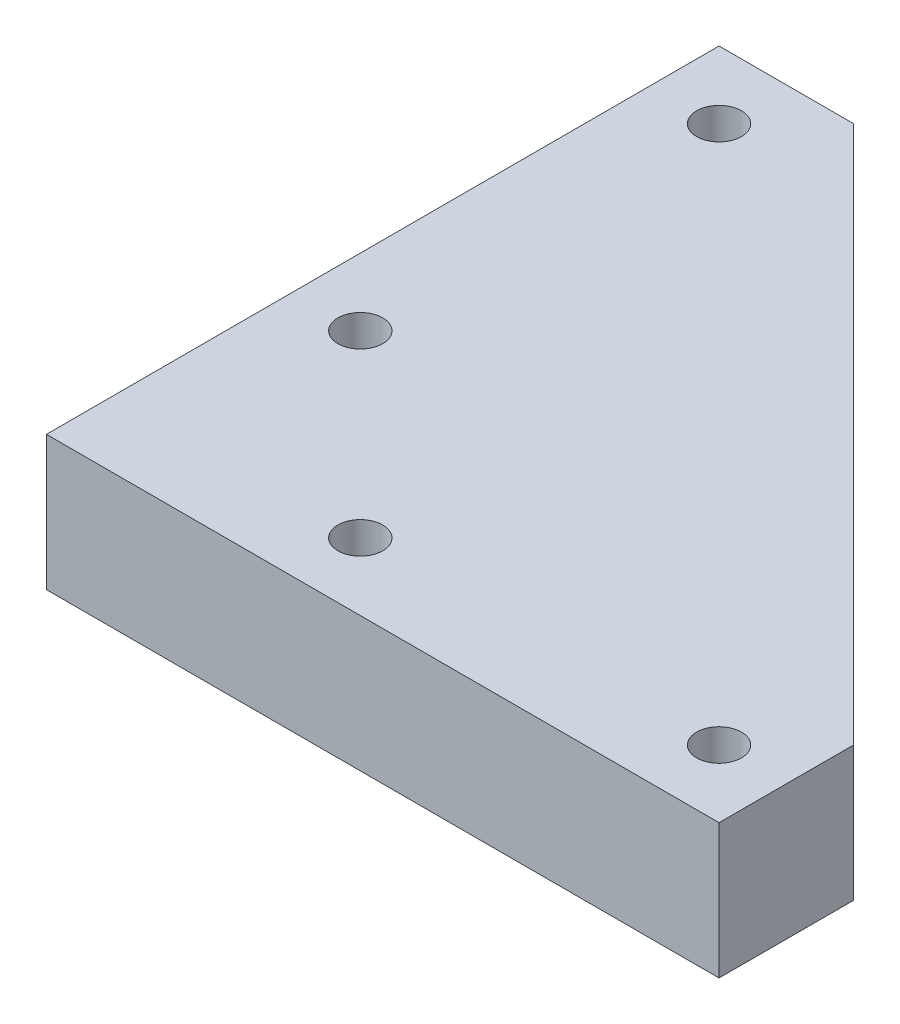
ISO-10303-21;
HEADER;
FILE_DESCRIPTION(('STEP AP214'),'2;1');
FILE_NAME('part.step','',(''),(''),'','','');
FILE_SCHEMA(('AUTOMOTIVE_DESIGN { 1 0 10303 214 1 1 1 1 }'));
ENDSEC;
DATA;
#1=APPLICATION_CONTEXT('core data for automotive mechanical design processes');
#2=APPLICATION_PROTOCOL_DEFINITION('international standard','automotive_design',2000,#1);
#3=PRODUCT_CONTEXT('',#1,'mechanical');
#4=PRODUCT('Part','Part','',(#3));
#5=PRODUCT_RELATED_PRODUCT_CATEGORY('part','',(#4));
#6=PRODUCT_DEFINITION_FORMATION('','',#4);
#7=PRODUCT_DEFINITION_CONTEXT('part definition',#1,'design');
#8=PRODUCT_DEFINITION('design','',#6,#7);
#9=PRODUCT_DEFINITION_SHAPE('','',#8);
#10=(LENGTH_UNIT() NAMED_UNIT(*) SI_UNIT(.MILLI.,.METRE.));
#11=(NAMED_UNIT(*) PLANE_ANGLE_UNIT() SI_UNIT($,.RADIAN.));
#12=(NAMED_UNIT(*) SI_UNIT($,.STERADIAN.) SOLID_ANGLE_UNIT());
#13=UNCERTAINTY_MEASURE_WITH_UNIT(LENGTH_MEASURE(1.E-05),#10,'distance_accuracy_value','');
#14=(GEOMETRIC_REPRESENTATION_CONTEXT(3) GLOBAL_UNCERTAINTY_ASSIGNED_CONTEXT((#13)) GLOBAL_UNIT_ASSIGNED_CONTEXT((#10,
#11,#12)) REPRESENTATION_CONTEXT('',''));
#15=CARTESIAN_POINT('',(0.,0.,0.));
#16=DIRECTION('',(0.,0.,1.));
#17=DIRECTION('',(1.,0.,0.));
#18=AXIS2_PLACEMENT_3D('',#15,#16,#17);
#19=CARTESIAN_POINT('',(0.,19.05,0.));
#20=DIRECTION('',(1.,0.,0.));
#21=DIRECTION('',(0.,0.,-1.));
#22=AXIS2_PLACEMENT_3D('',#19,#20,#21);
#23=PLANE('',#22);
#24=DIRECTION('',(0.,0.,1.));
#25=VECTOR('',#24,1.);
#26=CARTESIAN_POINT('',(0.,0.,0.));
#27=LINE('',#26,#25);
#28=CARTESIAN_POINT('',(0.,0.,0.));
#29=VERTEX_POINT('',#28);
#30=CARTESIAN_POINT('',(0.,0.,95.25));
#31=VERTEX_POINT('',#30);
#32=EDGE_CURVE('E98',#29,#31,#27,.T.);
#33=ORIENTED_EDGE('',*,*,#32,.T.);
#34=DIRECTION('',(0.,-1.,0.));
#35=VECTOR('',#34,1.);
#36=CARTESIAN_POINT('',(0.,19.05,95.25));
#37=LINE('',#36,#35);
#38=CARTESIAN_POINT('',(0.,19.05,95.25));
#39=VERTEX_POINT('',#38);
#40=EDGE_CURVE('E11',#39,#31,#37,.T.);
#41=ORIENTED_EDGE('',*,*,#40,.F.);
#42=DIRECTION('',(0.,0.,1.));
#43=VECTOR('',#42,1.);
#44=CARTESIAN_POINT('',(0.,19.05,0.));
#45=LINE('',#44,#43);
#46=CARTESIAN_POINT('',(0.,19.05,0.));
#47=VERTEX_POINT('',#46);
#48=EDGE_CURVE('E99',#47,#39,#45,.T.);
#49=ORIENTED_EDGE('',*,*,#48,.F.);
#50=DIRECTION('',(0.,-1.,0.));
#51=VECTOR('',#50,1.);
#52=CARTESIAN_POINT('',(0.,19.05,0.));
#53=LINE('',#52,#51);
#54=EDGE_CURVE('E107',#47,#29,#53,.T.);
#55=ORIENTED_EDGE('',*,*,#54,.T.);
#56=EDGE_LOOP('',(#33,#41,#49,#55));
#57=FACE_BOUND('',#56,.T.);
#58=ADVANCED_FACE('F32',(#57),#23,.F.);
#59=CARTESIAN_POINT('',(0.,19.05,95.25));
#60=DIRECTION('',(0.,0.,-1.));
#61=DIRECTION('',(-1.,0.,0.));
#62=AXIS2_PLACEMENT_3D('',#59,#60,#61);
#63=PLANE('',#62);
#64=DIRECTION('',(1.,0.,0.));
#65=VECTOR('',#64,1.);
#66=CARTESIAN_POINT('',(0.,0.,95.25));
#67=LINE('',#66,#65);
#68=CARTESIAN_POINT('',(95.25,0.,95.25));
#69=VERTEX_POINT('',#68);
#70=EDGE_CURVE('E103',#31,#69,#67,.T.);
#71=ORIENTED_EDGE('',*,*,#70,.T.);
#72=DIRECTION('',(0.,-1.,0.));
#73=VECTOR('',#72,1.);
#74=CARTESIAN_POINT('',(95.25,19.05,95.25));
#75=LINE('',#74,#73);
#76=CARTESIAN_POINT('',(95.25,19.05,95.25));
#77=VERTEX_POINT('',#76);
#78=EDGE_CURVE('E39',#77,#69,#75,.T.);
#79=ORIENTED_EDGE('',*,*,#78,.F.);
#80=DIRECTION('',(1.,0.,0.));
#81=VECTOR('',#80,1.);
#82=CARTESIAN_POINT('',(0.,19.05,95.25));
#83=LINE('',#82,#81);
#84=EDGE_CURVE('E78',#39,#77,#83,.T.);
#85=ORIENTED_EDGE('',*,*,#84,.F.);
#86=ORIENTED_EDGE('',*,*,#40,.T.);
#87=EDGE_LOOP('',(#71,#79,#85,#86));
#88=FACE_BOUND('',#87,.T.);
#89=ADVANCED_FACE('F115',(#88),#63,.F.);
#90=CARTESIAN_POINT('',(95.25,19.05,0.));
#91=DIRECTION('',(-1.,0.,0.));
#92=DIRECTION('',(0.,0.,1.));
#93=AXIS2_PLACEMENT_3D('',#90,#91,#92);
#94=PLANE('',#93);
#95=DIRECTION('',(0.,0.,-1.));
#96=VECTOR('',#95,1.);
#97=CARTESIAN_POINT('',(95.25,0.,0.));
#98=LINE('',#97,#96);
#99=CARTESIAN_POINT('',(95.25,0.,76.2));
#100=VERTEX_POINT('',#99);
#101=EDGE_CURVE('E100',#69,#100,#98,.T.);
#102=ORIENTED_EDGE('',*,*,#101,.T.);
#103=DIRECTION('',(0.,1.,0.));
#104=VECTOR('',#103,1.);
#105=CARTESIAN_POINT('',(95.25,0.,76.2));
#106=LINE('',#105,#104);
#107=CARTESIAN_POINT('',(95.25,19.05,76.2));
#108=VERTEX_POINT('',#107);
#109=EDGE_CURVE('E46',#100,#108,#106,.T.);
#110=ORIENTED_EDGE('',*,*,#109,.T.);
#111=DIRECTION('',(0.,0.,-1.));
#112=VECTOR('',#111,1.);
#113=CARTESIAN_POINT('',(95.25,19.05,0.));
#114=LINE('',#113,#112);
#115=EDGE_CURVE('E113',#77,#108,#114,.T.);
#116=ORIENTED_EDGE('',*,*,#115,.F.);
#117=ORIENTED_EDGE('',*,*,#78,.T.);
#118=EDGE_LOOP('',(#102,#110,#116,#117));
#119=FACE_BOUND('',#118,.T.);
#120=ADVANCED_FACE('F111',(#119),#94,.F.);
#121=CARTESIAN_POINT('',(0.,19.05,0.));
#122=DIRECTION('',(0.,0.,1.));
#123=DIRECTION('',(1.,0.,0.));
#124=AXIS2_PLACEMENT_3D('',#121,#122,#123);
#125=PLANE('',#124);
#126=DIRECTION('',(-1.,0.,0.));
#127=VECTOR('',#126,1.);
#128=CARTESIAN_POINT('',(0.,19.05,0.));
#129=LINE('',#128,#127);
#130=CARTESIAN_POINT('',(19.05,19.05,0.));
#131=VERTEX_POINT('',#130);
#132=EDGE_CURVE('E55',#131,#47,#129,.T.);
#133=ORIENTED_EDGE('',*,*,#132,.F.);
#134=DIRECTION('',(0.,1.,0.));
#135=VECTOR('',#134,1.);
#136=CARTESIAN_POINT('',(19.05,0.,0.));
#137=LINE('',#136,#135);
#138=CARTESIAN_POINT('',(19.05,0.,0.));
#139=VERTEX_POINT('',#138);
#140=EDGE_CURVE('E87',#139,#131,#137,.T.);
#141=ORIENTED_EDGE('',*,*,#140,.F.);
#142=DIRECTION('',(-1.,0.,0.));
#143=VECTOR('',#142,1.);
#144=CARTESIAN_POINT('',(0.,0.,0.));
#145=LINE('',#144,#143);
#146=EDGE_CURVE('E73',#139,#29,#145,.T.);
#147=ORIENTED_EDGE('',*,*,#146,.T.);
#148=ORIENTED_EDGE('',*,*,#54,.F.);
#149=EDGE_LOOP('',(#133,#141,#147,#148));
#150=FACE_BOUND('',#149,.T.);
#151=ADVANCED_FACE('F93',(#150),#125,.F.);
#152=CARTESIAN_POINT('',(0.,19.05,0.));
#153=DIRECTION('',(0.,1.,0.));
#154=DIRECTION('',(0.,0.,1.));
#155=AXIS2_PLACEMENT_3D('',#152,#153,#154);
#156=PLANE('',#155);
#157=CARTESIAN_POINT('',(34.925,19.05,85.725));
#158=DIRECTION('',(0.,1.,0.));
#159=DIRECTION('',(0.,0.,1.));
#160=AXIS2_PLACEMENT_3D('',#157,#158,#159);
#161=CIRCLE('',#160,3.175);
#162=CARTESIAN_POINT('',(34.925,19.05,88.9));
#163=VERTEX_POINT('',#162);
#164=EDGE_CURVE('E146',#163,#163,#161,.T.);
#165=ORIENTED_EDGE('',*,*,#164,.F.);
#166=EDGE_LOOP('',(#165));
#167=FACE_BOUND('',#166,.T.);
#168=CARTESIAN_POINT('',(9.525,19.05,60.325));
#169=DIRECTION('',(0.,1.,0.));
#170=DIRECTION('',(0.,0.,1.));
#171=AXIS2_PLACEMENT_3D('',#168,#169,#170);
#172=CIRCLE('',#171,3.175);
#173=CARTESIAN_POINT('',(9.525,19.05,63.5));
#174=VERTEX_POINT('',#173);
#175=EDGE_CURVE('E140',#174,#174,#172,.T.);
#176=ORIENTED_EDGE('',*,*,#175,.F.);
#177=EDGE_LOOP('',(#176));
#178=FACE_BOUND('',#177,.T.);
#179=CARTESIAN_POINT('',(85.725,19.05,85.725));
#180=DIRECTION('',(0.,1.,0.));
#181=DIRECTION('',(0.,0.,1.));
#182=AXIS2_PLACEMENT_3D('',#179,#180,#181);
#183=CIRCLE('',#182,3.175);
#184=CARTESIAN_POINT('',(85.725,19.05,88.9));
#185=VERTEX_POINT('',#184);
#186=EDGE_CURVE('E134',#185,#185,#183,.T.);
#187=ORIENTED_EDGE('',*,*,#186,.F.);
#188=EDGE_LOOP('',(#187));
#189=FACE_BOUND('',#188,.T.);
#190=CARTESIAN_POINT('',(9.52500000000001,19.05,9.525));
#191=DIRECTION('',(0.,1.,0.));
#192=DIRECTION('',(0.,0.,1.));
#193=AXIS2_PLACEMENT_3D('',#190,#191,#192);
#194=CIRCLE('',#193,3.175);
#195=CARTESIAN_POINT('',(9.52500000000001,19.05,12.7));
#196=VERTEX_POINT('',#195);
#197=EDGE_CURVE('E128',#196,#196,#194,.T.);
#198=ORIENTED_EDGE('',*,*,#197,.F.);
#199=EDGE_LOOP('',(#198));
#200=FACE_BOUND('',#199,.T.);
#201=DIRECTION('',(0.707106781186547,0.,0.707106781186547));
#202=VECTOR('',#201,1.);
#203=CARTESIAN_POINT('',(19.05,19.05,0.));
#204=LINE('',#203,#202);
#205=EDGE_CURVE('E91',#131,#108,#204,.T.);
#206=ORIENTED_EDGE('',*,*,#205,.F.);
#207=ORIENTED_EDGE('',*,*,#132,.T.);
#208=ORIENTED_EDGE('',*,*,#48,.T.);
#209=ORIENTED_EDGE('',*,*,#84,.T.);
#210=ORIENTED_EDGE('',*,*,#115,.T.);
#211=EDGE_LOOP('',(#206,#207,#208,#209,#210));
#212=FACE_BOUND('',#211,.T.);
#213=ADVANCED_FACE('F152',(#167,#178,#189,#200,#212),#156,.T.);
#214=CARTESIAN_POINT('',(0.,0.,0.));
#215=DIRECTION('',(0.,1.,0.));
#216=DIRECTION('',(0.,0.,1.));
#217=AXIS2_PLACEMENT_3D('',#214,#215,#216);
#218=PLANE('',#217);
#219=CARTESIAN_POINT('',(34.925,0.,85.725));
#220=DIRECTION('',(0.,1.,0.));
#221=DIRECTION('',(0.,0.,1.));
#222=AXIS2_PLACEMENT_3D('',#219,#220,#221);
#223=CIRCLE('',#222,3.175);
#224=CARTESIAN_POINT('',(34.925,0.,88.9));
#225=VERTEX_POINT('',#224);
#226=EDGE_CURVE('E143',#225,#225,#223,.T.);
#227=ORIENTED_EDGE('',*,*,#226,.T.);
#228=EDGE_LOOP('',(#227));
#229=FACE_BOUND('',#228,.T.);
#230=CARTESIAN_POINT('',(9.525,0.,60.325));
#231=DIRECTION('',(0.,1.,0.));
#232=DIRECTION('',(0.,0.,1.));
#233=AXIS2_PLACEMENT_3D('',#230,#231,#232);
#234=CIRCLE('',#233,3.175);
#235=CARTESIAN_POINT('',(9.525,0.,63.5));
#236=VERTEX_POINT('',#235);
#237=EDGE_CURVE('E137',#236,#236,#234,.T.);
#238=ORIENTED_EDGE('',*,*,#237,.T.);
#239=EDGE_LOOP('',(#238));
#240=FACE_BOUND('',#239,.T.);
#241=CARTESIAN_POINT('',(85.725,0.,85.725));
#242=DIRECTION('',(0.,1.,0.));
#243=DIRECTION('',(0.,0.,1.));
#244=AXIS2_PLACEMENT_3D('',#241,#242,#243);
#245=CIRCLE('',#244,3.175);
#246=CARTESIAN_POINT('',(85.725,0.,88.9));
#247=VERTEX_POINT('',#246);
#248=EDGE_CURVE('E131',#247,#247,#245,.T.);
#249=ORIENTED_EDGE('',*,*,#248,.T.);
#250=EDGE_LOOP('',(#249));
#251=FACE_BOUND('',#250,.T.);
#252=CARTESIAN_POINT('',(9.52500000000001,0.,9.525));
#253=DIRECTION('',(0.,1.,0.));
#254=DIRECTION('',(0.,0.,1.));
#255=AXIS2_PLACEMENT_3D('',#252,#253,#254);
#256=CIRCLE('',#255,3.175);
#257=CARTESIAN_POINT('',(9.52500000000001,0.,12.7));
#258=VERTEX_POINT('',#257);
#259=EDGE_CURVE('E124',#258,#258,#256,.T.);
#260=ORIENTED_EDGE('',*,*,#259,.T.);
#261=EDGE_LOOP('',(#260));
#262=FACE_BOUND('',#261,.T.);
#263=ORIENTED_EDGE('',*,*,#146,.F.);
#264=DIRECTION('',(0.707106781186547,0.,0.707106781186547));
#265=VECTOR('',#264,1.);
#266=CARTESIAN_POINT('',(19.05,0.,0.));
#267=LINE('',#266,#265);
#268=EDGE_CURVE('E85',#139,#100,#267,.T.);
#269=ORIENTED_EDGE('',*,*,#268,.T.);
#270=ORIENTED_EDGE('',*,*,#101,.F.);
#271=ORIENTED_EDGE('',*,*,#70,.F.);
#272=ORIENTED_EDGE('',*,*,#32,.F.);
#273=EDGE_LOOP('',(#263,#269,#270,#271,#272));
#274=FACE_BOUND('',#273,.T.);
#275=ADVANCED_FACE('F96',(#229,#240,#251,#262,#274),#218,.F.);
#276=CARTESIAN_POINT('',(19.05,0.,0.));
#277=DIRECTION('',(-0.707106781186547,0.,0.707106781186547));
#278=DIRECTION('',(0.707106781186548,0.,0.707106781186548));
#279=AXIS2_PLACEMENT_3D('',#276,#277,#278);
#280=PLANE('',#279);
#281=ORIENTED_EDGE('',*,*,#205,.T.);
#282=ORIENTED_EDGE('',*,*,#109,.F.);
#283=ORIENTED_EDGE('',*,*,#268,.F.);
#284=ORIENTED_EDGE('',*,*,#140,.T.);
#285=EDGE_LOOP('',(#281,#282,#283,#284));
#286=FACE_BOUND('',#285,.T.);
#287=ADVANCED_FACE('F86',(#286),#280,.F.);
#288=CARTESIAN_POINT('',(9.52500000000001,19.05,9.525));
#289=DIRECTION('',(0.,1.,0.));
#290=DIRECTION('',(0.,0.,1.));
#291=AXIS2_PLACEMENT_3D('',#288,#289,#290);
#292=CYLINDRICAL_SURFACE('',#291,3.175);
#293=ORIENTED_EDGE('',*,*,#259,.F.);
#294=EDGE_LOOP('',(#293));
#295=FACE_BOUND('',#294,.T.);
#296=ORIENTED_EDGE('',*,*,#197,.T.);
#297=EDGE_LOOP('',(#296));
#298=FACE_BOUND('',#297,.T.);
#299=ADVANCED_FACE('F162',(#295,#298),#292,.F.);
#300=CARTESIAN_POINT('',(85.725,19.05,85.725));
#301=DIRECTION('',(0.,1.,0.));
#302=DIRECTION('',(0.,0.,1.));
#303=AXIS2_PLACEMENT_3D('',#300,#301,#302);
#304=CYLINDRICAL_SURFACE('',#303,3.175);
#305=ORIENTED_EDGE('',*,*,#248,.F.);
#306=EDGE_LOOP('',(#305));
#307=FACE_BOUND('',#306,.T.);
#308=ORIENTED_EDGE('',*,*,#186,.T.);
#309=EDGE_LOOP('',(#308));
#310=FACE_BOUND('',#309,.T.);
#311=ADVANCED_FACE('F164',(#307,#310),#304,.F.);
#312=CARTESIAN_POINT('',(9.525,19.05,60.325));
#313=DIRECTION('',(0.,1.,0.));
#314=DIRECTION('',(0.,0.,1.));
#315=AXIS2_PLACEMENT_3D('',#312,#313,#314);
#316=CYLINDRICAL_SURFACE('',#315,3.175);
#317=ORIENTED_EDGE('',*,*,#237,.F.);
#318=EDGE_LOOP('',(#317));
#319=FACE_BOUND('',#318,.T.);
#320=ORIENTED_EDGE('',*,*,#175,.T.);
#321=EDGE_LOOP('',(#320));
#322=FACE_BOUND('',#321,.T.);
#323=ADVANCED_FACE('F171',(#319,#322),#316,.F.);
#324=CARTESIAN_POINT('',(34.925,19.05,85.725));
#325=DIRECTION('',(0.,1.,0.));
#326=DIRECTION('',(0.,0.,1.));
#327=AXIS2_PLACEMENT_3D('',#324,#325,#326);
#328=CYLINDRICAL_SURFACE('',#327,3.175);
#329=ORIENTED_EDGE('',*,*,#226,.F.);
#330=EDGE_LOOP('',(#329));
#331=FACE_BOUND('',#330,.T.);
#332=ORIENTED_EDGE('',*,*,#164,.T.);
#333=EDGE_LOOP('',(#332));
#334=FACE_BOUND('',#333,.T.);
#335=ADVANCED_FACE('F150',(#331,#334),#328,.F.);
#336=CLOSED_SHELL('',(#58,#89,#120,#151,#213,#275,#287,#299,#311,#323,#335));
#337=MANIFOLD_SOLID_BREP('B2',#336);
#338=ADVANCED_BREP_SHAPE_REPRESENTATION('',(#18,#337),#14);
#339=SHAPE_DEFINITION_REPRESENTATION(#9,#338);
ENDSEC;
END-ISO-10303-21;
